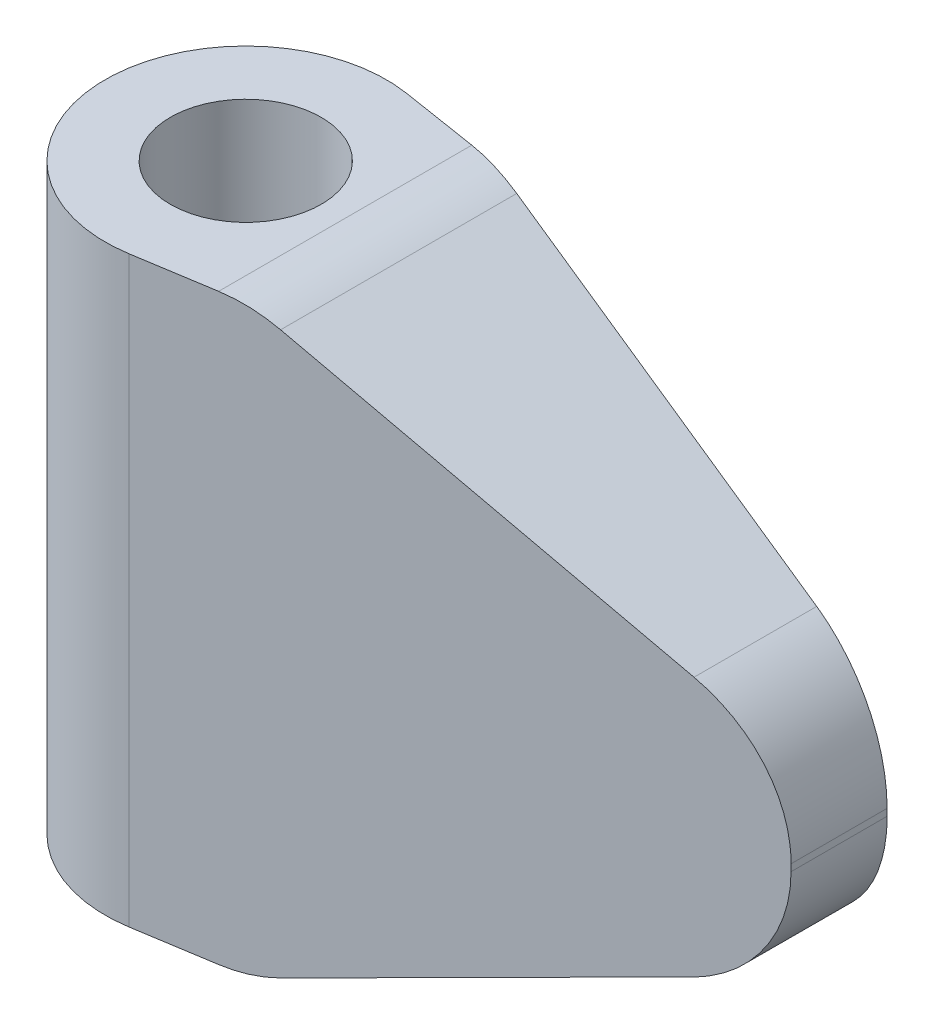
from build123d import *

# Parameters (mm, degrees)
ESQUISSE1_R                  = 11
BOSS_EXTRU_1_DEPTH           = 42.5
ENL_V_MAT_EXTRU_1_DEPTH      = 99.532989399
ENL_V_MAT_EXTRU_1_DEPTH_BACK = 99.532989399


with BuildPart() as part:
    # Esquisse1 → Boss.-Extru.1 (new, symmetric)
    with BuildSketch(Plane(origin=(0, 0, 0), x_dir=(1, 0, 0), z_dir=(0, 1, 0))):
        with BuildLine():
            Line((3.220014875, 20.245530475), (86.5, 7))
            Line((86.5, 7), (86.5, -7))
            Line((86.5, -7), (3.220014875, -20.245530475))
            ThreePointArc((3.220014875, -20.245530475), (-20.5, 0), (3.220014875, 20.245530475))
        make_face()
        with Locations(Location((0, 0, 0), (0, 0, 270))):
            Circle(ESQUISSE1_R, mode=Mode.SUBTRACT)
    extrude(amount=BOSS_EXTRU_1_DEPTH, both=True)

    # Esquisse2 → Enl_v. mat.-Extru.1 (cut, two sides: drawn at the far end of the back side and taken through both)
    with BuildSketch(Plane.XY.offset(-ENL_V_MAT_EXTRU_1_DEPTH_BACK)):
        with BuildLine():
            Line((22.292799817, 40.919345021), (74.292799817, 18.919345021))
            ThreePointArc((74.292799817, 18.919345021), (83.171172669, 11.548619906), (86.5, 0.5))
            Line((86.5, 0.5), (86.5, 42.5))
            Line((86.5, 42.5), (14.5, 42.5))
            ThreePointArc((14.5, 42.5), (18.475745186, 42.100853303), (22.292799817, 40.919345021))
        make_face()
        with BuildLine():
            Line((86.5, -42.5), (14.5, -42.5))
            ThreePointArc((14.5, -42.5), (18.475745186, -42.100853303), (22.292799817, -40.919345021))
            Line((22.292799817, -40.919345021), (74.292799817, -18.919345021))
            ThreePointArc((74.292799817, -18.919345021), (83.171172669, -11.548619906), (86.5, -0.5))
            Line((86.5, -0.5), (86.5, -42.5))
        make_face()
    extrude(amount=ENL_V_MAT_EXTRU_1_DEPTH + ENL_V_MAT_EXTRU_1_DEPTH_BACK, mode=Mode.SUBTRACT)


solid = part.part
